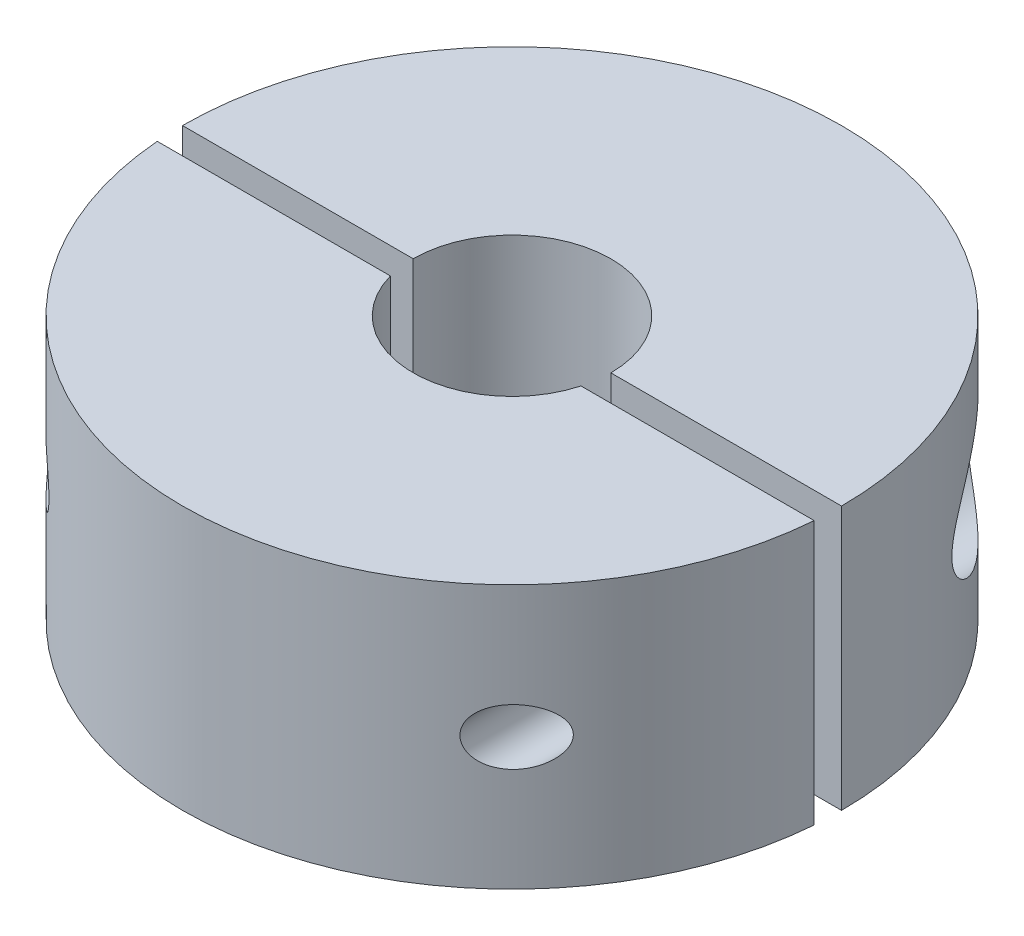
from build123d import *

# Parameters (mm, degrees)
SKETCH1_R                      = 15.875
SKETCH1_R_2                    = 4.7625
EXTRUDE1_DEPTH                 = 12.7
CUT_EXTRUDE1_DEPTH             = 26.793821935
SKETCH3_R                      = 1.778
CUT_EXTRUDE2_DEPTH             = 12.7
SKETCH4_R                      = 3.048
CUT_EXTRUDE3_DEPTH             = 12.7
F_6_32_TAPPED_HOLE1_AT_2_COUNT = 2
F_6_32_TAPPED_HOLE1_AT_2_PITCH = 22.504778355


with BuildPart() as part:
    # Sketch1 → Extrude1 (new body)
    with BuildSketch(Plane(origin=(0, 0, 0), x_dir=(1, 0, 0), z_dir=(0, 1, 0))):
        with Locations(Location((0, 0, 0), (0, 0, 270))):
            Circle(SKETCH1_R)
        with Locations(Location((0, 0, 0), (0, 0, 270))):
            Circle(SKETCH1_R_2, mode=Mode.SUBTRACT)
    extrude(amount=EXTRUDE1_DEPTH)

    # Sketch2 → Cut-Extrude1 (cut, through all)
    with BuildSketch(Plane(origin=(0, 12.7, 0), x_dir=(-1, 0, 0), z_dir=(0, 1, 0))):
        Polygon((0, 0), (21.907875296, 0), (21.907875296, 1.26662234), (-18.952423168, 1.26662234), (-18.952423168, 0), align=None)
    extrude(amount=-CUT_EXTRUDE1_DEPTH, mode=Mode.SUBTRACT)


with BuildPart() as cut_extrude1_piece_1:
    # of the separate pieces the step leaves, piece 1, a body of its own (cut_extrude1_pieces)
    add(part.part.solids().sort_by_distance((15.875, 0, 0))[0])

    # Sketch3 → Cut-Extrude2 (cut)
    with BuildSketch(Plane.XY):
        with Locations((11.252389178, 6.35)):
            Circle(SKETCH3_R)
        with Locations((-11.252389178, 6.35)):
            Circle(SKETCH3_R)
    extrude(amount=-CUT_EXTRUDE2_DEPTH, mode=Mode.SUBTRACT)

    # Sketch4 → Cut-Extrude3 (cut)
    with BuildSketch(Plane.XY.offset(-6.35)):
        with Locations((11.252389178, 6.35)):
            Circle(SKETCH4_R)
        with Locations((-11.252389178, 6.35)):
            Circle(SKETCH4_R)
    extrude(amount=-CUT_EXTRUDE3_DEPTH, mode=Mode.SUBTRACT)


with BuildPart() as cut_extrude1_piece_2:
    # of the separate pieces the step leaves, piece 2, a body of its own (cut_extrude1_pieces)
    add(part.part.solids().sort_by_distance((-15.824389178, 0, 1.26662234))[0])

    # Sketch6 → 6-32 Tapped Hole1 (revolve, cut)
    with BuildSketch(Plane(origin=(11.252389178, 6.35, 1.26662234), x_dir=(0, 1, 0), z_dir=(1, 0, 0))):
        Polygon((0, 0), (0, 11.98869403), (1.35255, 11.176), (1.35255, 0), align=None)
    f_6_32_tapped_hole1 = revolve(axis=Axis((11.252389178, 6.35, -5.08337766), (0, 0, 1)), mode=Mode.SUBTRACT)

    # 6-32 Tapped Hole1 at 2: 6-32 Tapped Hole1 ×2
    with Locations(*[(-i * F_6_32_TAPPED_HOLE1_AT_2_PITCH, 0, 0) for i in range(1, F_6_32_TAPPED_HOLE1_AT_2_COUNT)]):
        add(f_6_32_tapped_hole1, mode=Mode.SUBTRACT)


solid = Compound([cut_extrude1_piece_1.part, cut_extrude1_piece_2.part])
